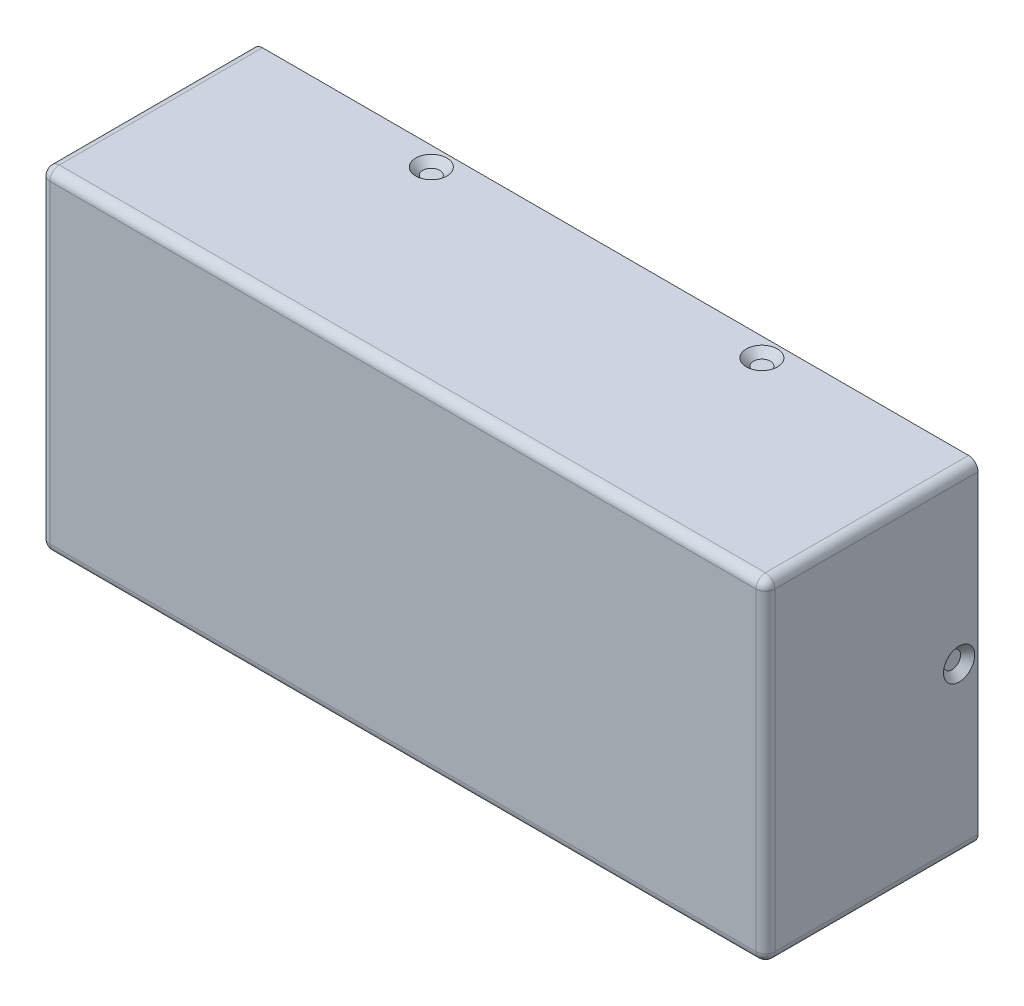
from build123d import *

# Parameters (mm, degrees)
SKETCH_1_W               = 153.5
SKETCH_1_H               = 70.5
EXTRUDE_1_DEPTH          = 45
FILLET_1_R               = 2
SHELL_1_T                = -1.5
SKETCH_2_W               = 150
SKETCH_2_H               = 67
EXTRUDE_2_DEPTH          = 12
HOLE_WIZARD_1_AT_2_COUNT = 2
HOLE_WIZARD_1_AT_2_PITCH = 70


with BuildPart() as part:
    # Sketch 1 → Extrude 1 (new body)
    with BuildSketch(Plane.XY):
        Rectangle(SKETCH_1_W, SKETCH_1_H)
    extrude(amount=EXTRUDE_1_DEPTH)

    # Fillet 1
    fillet_1_edges = [part.edges().sort_by_distance(p)[0] for p in [
        (-76.75, 0, 45),
        (0, -35.25, 45),
        (76.75, 0, 45),
        (0, 35.25, 45),
        (76.75, -35.25, 22.5),
        (-76.75, -35.25, 22.5),
        (-76.75, 35.25, 22.5),
        (76.75, 35.25, 22.5),
    ]]
    fillet(fillet_1_edges, radius=FILLET_1_R)

    # Shell 1
    shell_1_openings = [part.faces().sort_by_distance(p)[0] for p in [
        (0, 0, 0),
    ]]
    offset(amount=SHELL_1_T, openings=shell_1_openings, kind=Kind.INTERSECTION)

    # Sketch 4 → Hole Wizard 1 (revolve, cut)
    with BuildSketch(Plane(origin=(35, -35.25, 4), x_dir=(0, 0, -1), z_dir=(1, 0, 0))):
        Polygon((0, 0), (0, 70.5), (1.7, 70.5), (1.7, 1.6), (3.3, 0), align=None)
    hole_wizard_1 = revolve(axis=Axis((35, -41.6, 4), (0, 1, 0)), mode=Mode.SUBTRACT)

    # Hole Wizard 1 at 2: Hole Wizard 1 ×2
    with Locations(*[(-i * HOLE_WIZARD_1_AT_2_PITCH, 0, 0) for i in range(1, HOLE_WIZARD_1_AT_2_COUNT)]):
        add(hole_wizard_1, mode=Mode.SUBTRACT)

    # Mirror 1: Hole Wizard 1 across plane
    add(hole_wizard_1.mirror(Plane.ZX), mode=Mode.SUBTRACT)

    # Mirror 1 copy 1 sketch → Mirror 1 copy 1 (revolve, cut)
    with BuildSketch(Plane(origin=(-35, 35.25, 4), x_dir=(0, 0, -1), z_dir=(1, 0, 0))):
        Polygon((0, 0), (0, -70.5), (1.7, -70.5), (1.7, -1.6), (3.3, 0), align=None)
    revolve(axis=Axis((-35, 41.6, 4), (0, 1, 0)), mode=Mode.SUBTRACT)

    # Sketch 7 → Hole Wizard 2 (revolve, cut)
    with BuildSketch(Plane(origin=(-76.75, 0, 4), x_dir=(0, 0, 1), z_dir=(0, 1, 0))):
        Polygon((0, 0), (0, 153.5), (1.7, 153.5), (1.7, 1.6), (3.3, 0), align=None)
    hole_wizard_2 = revolve(axis=Axis((-83.1, 0, 4), (1, 0, 0)), mode=Mode.SUBTRACT)

    # Mirror 2: Hole Wizard 2 across plane
    add(hole_wizard_2.mirror(Plane(origin=(0, 0, 0), x_dir=(0, 0, 1), z_dir=(1, 0, 0))), mode=Mode.SUBTRACT)


with BuildPart() as body_2:
    # Sketch 2 → Extrude 2 (new body)
    with BuildSketch(Plane(origin=(0, 0, 0), x_dir=(-1, 0, 0), z_dir=(0, 0, -1))):
        Rectangle(SKETCH_2_W, SKETCH_2_H)
    extrude(amount=-EXTRUDE_2_DEPTH)


solid = Compound([part.part, body_2.part])
